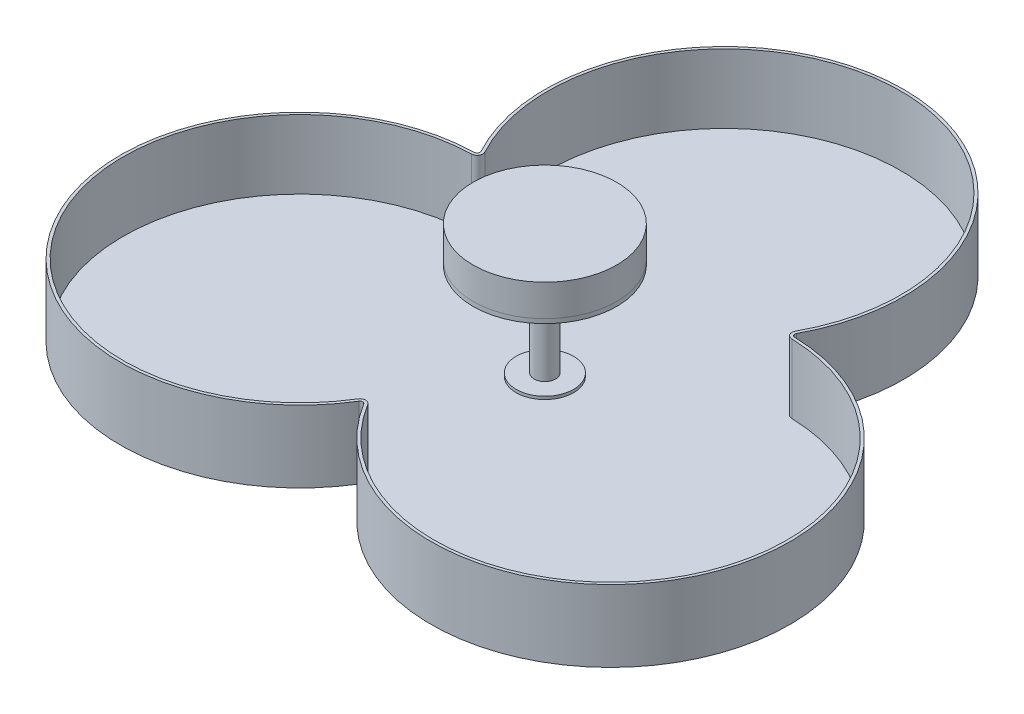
from build123d import *

# Parameters (mm, degrees)
CROQUIS1_R               = 50
SALIENTE_EXTRUIR1_DEPTH  = 40
CROQUIS7_R               = 7.5
SALIENTE_EXTRUIR6_DEPTH  = 70
VACIADO4_T               = -2
CROQUIS8_R               = 20
CROQUIS8_R_2             = 7.5
SALIENTE_EXTRUIR7_DEPTH  = 2
SALIENTE_EXTRUIR2_DEPTH  = 50
REDONDEO1_R              = 2
VACIADO3_T               = -2
CROQUIS7_3_R             = 7.5
CORTAR_EXTRUIR2_DEPTH    = 103
CROQUIS9_R               = 20
CROQUIS9_R_2             = 7.5
SALIENTE_EXTRUIR8_DEPTH  = 2
CROQUIS10_R              = 50
SALIENTE_EXTRUIR9_DEPTH  = 3
CROQUIS11_R              = 50
SALIENTE_EXTRUIR10_DEPTH = 22


with BuildPart() as part:
    # Croquis1 → Saliente-Extruir1 (new body)
    with BuildSketch(Plane(origin=(0, 0, 0), x_dir=(1, 0, 0), z_dir=(0, 1, 0))):
        with Locations(Location((0, 0, 0), (0, 0, 270))):
            Circle(CROQUIS1_R)
    extrude(amount=SALIENTE_EXTRUIR1_DEPTH)

    # Croquis7 → Saliente-Extruir6 (add)
    with BuildSketch(Plane(origin=(0, 40, 0), x_dir=(1, 0, 0), z_dir=(0, 1, 0))):
        with Locations(Location((0, 0, 0), (0, 0, 270))):
            Circle(CROQUIS7_R)
    extrude(amount=SALIENTE_EXTRUIR6_DEPTH)

    # Vaciado4
    vaciado4_openings = [part.faces().sort_by_distance(p)[0] for p in [
        (0, 0, 0),
        (0, 110, 0),
    ]]
    offset(amount=VACIADO4_T, openings=vaciado4_openings, kind=Kind.INTERSECTION)


with BuildPart() as body_2:
    # Croquis8 → Saliente-Extruir7 (new body)
    with BuildSketch(Plane(origin=(0, 39, 0), x_dir=(1, 0, 0), z_dir=(0, 1, 0))):
        with Locations(Location((0, 0, 0), (0, 0, 270))):
            Circle(CROQUIS8_R)
        with Locations(Location((0, 0, 0), (0, 0, 270))):
            Circle(CROQUIS8_R_2, mode=Mode.SUBTRACT)
    extrude(amount=SALIENTE_EXTRUIR7_DEPTH)


with BuildPart() as body_3:
    # Croquis2 → Saliente-Extruir2 (new body)
    with BuildSketch(Plane(origin=(0, 41, 0), x_dir=(1, 0, 0), z_dir=(0, 1, 0))):
        with BuildLine():
            ThreePointArc((108.253175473, 62.5), (0, 250), (-108.253175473, 62.5))
            ThreePointArc((-108.253175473, 62.5), (-216.506350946, -125), (0, -125))
            ThreePointArc((0, -125), (216.506350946, -125), (108.253175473, 62.5))
        make_face()
    extrude(amount=SALIENTE_EXTRUIR2_DEPTH)

    # Redondeo1
    redondeo1_edges = [body_3.edges().sort_by_distance(p)[0] for p in [
        (0, 66, 125),
        (-108.253175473, 66, -62.5),
        (108.253175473, 66, -62.5),
    ]]
    fillet(redondeo1_edges, radius=REDONDEO1_R)

    # Vaciado3
    vaciado3_openings = [body_3.faces().sort_by_distance(p)[0] for p in [
        (1e-09, 91, 3e-09),
    ]]
    offset(amount=VACIADO3_T, openings=vaciado3_openings, kind=Kind.INTERSECTION)

    # Croquis7_3 → Cortar-Extruir2 (cut)
    with BuildSketch(Plane(origin=(0, 40, 0), x_dir=(1, 0, 0), z_dir=(0, 1, 0))):
        with Locations(Location((0, 0, 0), (0, 0, 90))):
            Circle(CROQUIS7_3_R)
    extrude(amount=CORTAR_EXTRUIR2_DEPTH, mode=Mode.SUBTRACT)


with BuildPart() as body_4:
    # Croquis9 → Saliente-Extruir8 (new body)
    with BuildSketch(Plane(origin=(0, 43, 0), x_dir=(1, 0, 0), z_dir=(0, 1, 0))):
        with Locations(Location((0, 0, 0), (0, 0, 270))):
            Circle(CROQUIS9_R)
        with Locations(Location((0, 0, 0), (0, 0, 270))):
            Circle(CROQUIS9_R_2, mode=Mode.SUBTRACT)
    extrude(amount=SALIENTE_EXTRUIR8_DEPTH)


with BuildPart() as body_5:
    # Croquis10 → Saliente-Extruir9 (new body)
    with BuildSketch(Plane(origin=(0, 110, 0), x_dir=(1, 0, 0), z_dir=(0, 1, 0))):
        with Locations(Location((0, 0, 0), (0, 0, 270))):
            Circle(CROQUIS10_R)
    extrude(amount=SALIENTE_EXTRUIR9_DEPTH)


with BuildPart() as body_6:
    # Croquis11 → Saliente-Extruir10 (new body)
    with BuildSketch(Plane(origin=(0, 113, 0), x_dir=(1, 0, 0), z_dir=(0, 1, 0))):
        with Locations(Location((0, 0, 0), (0, 0, 270))):
            Circle(CROQUIS11_R)
    extrude(amount=SALIENTE_EXTRUIR10_DEPTH)


solid = Compound([part.part, body_2.part, body_3.part, body_4.part, body_5.part, body_6.part])
